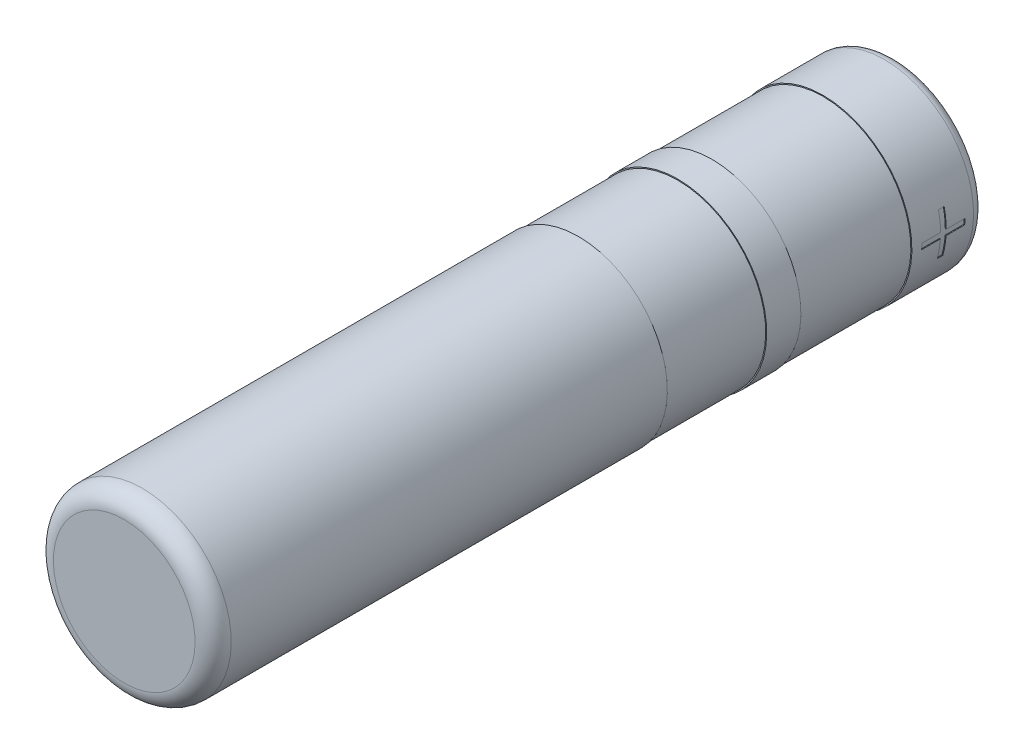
ISO-10303-21;
HEADER;
FILE_DESCRIPTION(('STEP AP214'),'2;1');
FILE_NAME('part.step','',(''),(''),'','','');
FILE_SCHEMA(('AUTOMOTIVE_DESIGN { 1 0 10303 214 1 1 1 1 }'));
ENDSEC;
DATA;
#1=APPLICATION_CONTEXT('core data for automotive mechanical design processes');
#2=APPLICATION_PROTOCOL_DEFINITION('international standard','automotive_design',2000,#1);
#3=PRODUCT_CONTEXT('',#1,'mechanical');
#4=PRODUCT('Part','Part','',(#3));
#5=PRODUCT_RELATED_PRODUCT_CATEGORY('part','',(#4));
#6=PRODUCT_DEFINITION_FORMATION('','',#4);
#7=PRODUCT_DEFINITION_CONTEXT('part definition',#1,'design');
#8=PRODUCT_DEFINITION('design','',#6,#7);
#9=PRODUCT_DEFINITION_SHAPE('','',#8);
#10=(LENGTH_UNIT() NAMED_UNIT(*) SI_UNIT(.MILLI.,.METRE.));
#11=(NAMED_UNIT(*) PLANE_ANGLE_UNIT() SI_UNIT($,.RADIAN.));
#12=(NAMED_UNIT(*) SI_UNIT($,.STERADIAN.) SOLID_ANGLE_UNIT());
#13=UNCERTAINTY_MEASURE_WITH_UNIT(LENGTH_MEASURE(1.E-05),#10,'distance_accuracy_value','');
#14=(GEOMETRIC_REPRESENTATION_CONTEXT(3) GLOBAL_UNCERTAINTY_ASSIGNED_CONTEXT((#13)) GLOBAL_UNIT_ASSIGNED_CONTEXT((#10,
#11,#12)) REPRESENTATION_CONTEXT('',''));
#15=CARTESIAN_POINT('',(0.,0.,0.));
#16=DIRECTION('',(0.,0.,1.));
#17=DIRECTION('',(1.,0.,0.));
#18=AXIS2_PLACEMENT_3D('',#15,#16,#17);
#19=CARTESIAN_POINT('',(0.,0.,-44.24));
#20=DIRECTION('',(0.,0.,-1.));
#21=DIRECTION('',(0.,1.,0.));
#22=AXIS2_PLACEMENT_3D('',#19,#20,#21);
#23=CYLINDRICAL_SURFACE('',#22,4.915);
#24=CARTESIAN_POINT('',(0.,0.,-42.04));
#25=DIRECTION('',(0.,0.,-1.));
#26=DIRECTION('',(0.,1.,0.));
#27=AXIS2_PLACEMENT_3D('',#24,#25,#26);
#28=CIRCLE('',#27,4.915);
#29=CARTESIAN_POINT('',(0.,4.91499999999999,-42.04));
#30=VERTEX_POINT('',#29);
#31=EDGE_CURVE('E185',#30,#30,#28,.T.);
#32=ORIENTED_EDGE('',*,*,#31,.F.);
#33=EDGE_LOOP('',(#32));
#34=FACE_BOUND('',#33,.T.);
#35=CARTESIAN_POINT('',(0.,0.,-38.6323807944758));
#36=DIRECTION('',(0.,0.,-1.));
#37=DIRECTION('',(0.,1.,0.));
#38=AXIS2_PLACEMENT_3D('',#35,#36,#37);
#39=CIRCLE('',#38,4.915);
#40=CARTESIAN_POINT('',(0.,4.91499999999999,-38.6323807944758));
#41=VERTEX_POINT('',#40);
#42=EDGE_CURVE('E188',#41,#41,#39,.T.);
#43=ORIENTED_EDGE('',*,*,#42,.T.);
#44=EDGE_LOOP('',(#43));
#45=FACE_BOUND('',#44,.T.);
#46=CARTESIAN_POINT('',(0.,0.,-40.2137290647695));
#47=DIRECTION('',(0.,0.,-1.));
#48=DIRECTION('',(-1.,0.,0.));
#49=AXIS2_PLACEMENT_3D('',#46,#47,#48);
#50=CIRCLE('',#49,4.915);
#51=CARTESIAN_POINT('',(4.72970311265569,-1.33683711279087,-40.2137290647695));
#52=VERTEX_POINT('',#51);
#53=CARTESIAN_POINT('',(4.90554080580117,-0.304785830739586,-40.2137290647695));
#54=VERTEX_POINT('',#53);
#55=EDGE_CURVE('E50',#52,#54,#50,.F.);
#56=ORIENTED_EDGE('',*,*,#55,.T.);
#57=DIRECTION('',(0.,0.,-1.));
#58=VECTOR('',#57,1.);
#59=CARTESIAN_POINT('',(4.90554080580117,-0.304785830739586,-44.24));
#60=LINE('',#59,#58);
#61=CARTESIAN_POINT('',(4.90554080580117,-0.304785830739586,-39.1816777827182));
#62=VERTEX_POINT('',#61);
#63=EDGE_CURVE('E12',#54,#62,#60,.F.);
#64=ORIENTED_EDGE('',*,*,#63,.T.);
#65=CARTESIAN_POINT('',(0.,0.,-39.1816777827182));
#66=DIRECTION('',(0.,0.,-1.));
#67=DIRECTION('',(-1.,0.,0.));
#68=AXIS2_PLACEMENT_3D('',#65,#66,#67);
#69=CIRCLE('',#68,4.915);
#70=CARTESIAN_POINT('',(4.91499116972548,0.00931673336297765,-39.1816777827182));
#71=VERTEX_POINT('',#70);
#72=EDGE_CURVE('E35',#62,#71,#69,.F.);
#73=ORIENTED_EDGE('',*,*,#72,.T.);
#74=DIRECTION('',(0.,0.,-1.));
#75=VECTOR('',#74,1.);
#76=CARTESIAN_POINT('',(4.91499116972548,0.00931673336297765,-44.24));
#77=LINE('',#76,#75);
#78=CARTESIAN_POINT('',(4.91499116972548,0.00931673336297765,-40.2137290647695));
#79=VERTEX_POINT('',#78);
#80=EDGE_CURVE('E240',#71,#79,#77,.T.);
#81=ORIENTED_EDGE('',*,*,#80,.T.);
#82=CARTESIAN_POINT('',(0.,0.,-40.2137290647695));
#83=DIRECTION('',(0.,0.,-1.));
#84=DIRECTION('',(-1.,0.,0.));
#85=AXIS2_PLACEMENT_3D('',#82,#83,#84);
#86=CIRCLE('',#85,4.915);
#87=CARTESIAN_POINT('',(4.80341312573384,1.04136801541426,-40.2137290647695));
#88=VERTEX_POINT('',#87);
#89=EDGE_CURVE('E238',#79,#88,#86,.F.);
#90=ORIENTED_EDGE('',*,*,#89,.T.);
#91=DIRECTION('',(0.,0.,-1.));
#92=VECTOR('',#91,1.);
#93=CARTESIAN_POINT('',(4.80341312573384,1.04136801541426,-44.24));
#94=LINE('',#93,#92);
#95=CARTESIAN_POINT('',(4.80341312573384,1.04136801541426,-40.5278316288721));
#96=VERTEX_POINT('',#95);
#97=EDGE_CURVE('E137',#88,#96,#94,.T.);
#98=ORIENTED_EDGE('',*,*,#97,.T.);
#99=CARTESIAN_POINT('',(0.,0.,-40.5278316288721));
#100=DIRECTION('',(0.,0.,1.));
#101=DIRECTION('',(1.,0.,0.));
#102=AXIS2_PLACEMENT_3D('',#99,#100,#101);
#103=CIRCLE('',#102,4.915);
#104=CARTESIAN_POINT('',(4.91499116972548,0.00931673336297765,-40.5278316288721));
#105=VERTEX_POINT('',#104);
#106=EDGE_CURVE('E234',#96,#105,#103,.F.);
#107=ORIENTED_EDGE('',*,*,#106,.T.);
#108=DIRECTION('',(0.,0.,-1.));
#109=VECTOR('',#108,1.);
#110=CARTESIAN_POINT('',(4.91499116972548,0.00931673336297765,-44.24));
#111=LINE('',#110,#109);
#112=CARTESIAN_POINT('',(4.91499116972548,0.00931673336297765,-41.5598829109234));
#113=VERTEX_POINT('',#112);
#114=EDGE_CURVE('E230',#105,#113,#111,.T.);
#115=ORIENTED_EDGE('',*,*,#114,.T.);
#116=CARTESIAN_POINT('',(0.,0.,-41.5598829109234));
#117=DIRECTION('',(0.,0.,1.));
#118=DIRECTION('',(1.,0.,0.));
#119=AXIS2_PLACEMENT_3D('',#116,#117,#118);
#120=CIRCLE('',#119,4.915);
#121=CARTESIAN_POINT('',(4.90554080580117,-0.304785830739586,-41.5598829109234));
#122=VERTEX_POINT('',#121);
#123=EDGE_CURVE('E227',#113,#122,#120,.F.);
#124=ORIENTED_EDGE('',*,*,#123,.T.);
#125=DIRECTION('',(0.,0.,-1.));
#126=VECTOR('',#125,1.);
#127=CARTESIAN_POINT('',(4.90554080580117,-0.304785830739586,-44.24));
#128=LINE('',#127,#126);
#129=CARTESIAN_POINT('',(4.90554080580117,-0.304785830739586,-40.5278316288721));
#130=VERTEX_POINT('',#129);
#131=EDGE_CURVE('E224',#122,#130,#128,.F.);
#132=ORIENTED_EDGE('',*,*,#131,.T.);
#133=CARTESIAN_POINT('',(0.,0.,-40.5278316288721));
#134=DIRECTION('',(0.,0.,1.));
#135=DIRECTION('',(1.,0.,0.));
#136=AXIS2_PLACEMENT_3D('',#133,#134,#135);
#137=CIRCLE('',#136,4.915);
#138=CARTESIAN_POINT('',(4.72970311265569,-1.33683711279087,-40.5278316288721));
#139=VERTEX_POINT('',#138);
#140=EDGE_CURVE('E218',#130,#139,#137,.F.);
#141=ORIENTED_EDGE('',*,*,#140,.T.);
#142=DIRECTION('',(0.,0.,-1.));
#143=VECTOR('',#142,1.);
#144=CARTESIAN_POINT('',(4.72970311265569,-1.33683711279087,-44.24));
#145=LINE('',#144,#143);
#146=EDGE_CURVE('E221',#139,#52,#145,.F.);
#147=ORIENTED_EDGE('',*,*,#146,.T.);
#148=EDGE_LOOP('',(#56,#64,#73,#81,#90,#98,#107,#115,#124,#132,#141,#147));
#149=FACE_BOUND('',#148,.T.);
#150=ADVANCED_FACE('F27',(#34,#45,#149),#23,.T.);
#151=CARTESIAN_POINT('',(0.,0.,0.));
#152=DIRECTION('',(0.,0.,1.));
#153=DIRECTION('',(0.,-1.,0.));
#154=AXIS2_PLACEMENT_3D('',#151,#152,#153);
#155=PLANE('',#154);
#156=CARTESIAN_POINT('',(0.,0.,0.));
#157=DIRECTION('',(0.,0.,-1.));
#158=DIRECTION('',(0.,1.,0.));
#159=AXIS2_PLACEMENT_3D('',#156,#157,#158);
#160=CIRCLE('',#159,3.91499999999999);
#161=CARTESIAN_POINT('',(0.,3.91499999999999,0.));
#162=VERTEX_POINT('',#161);
#163=EDGE_CURVE('E215',#162,#162,#160,.T.);
#164=ORIENTED_EDGE('',*,*,#163,.F.);
#165=EDGE_LOOP('',(#164));
#166=FACE_BOUND('',#165,.T.);
#167=ADVANCED_FACE('F29',(#166),#155,.T.);
#168=CARTESIAN_POINT('',(0.,0.,-1.));
#169=DIRECTION('',(0.,0.,-1.));
#170=DIRECTION('',(0.,1.,0.));
#171=AXIS2_PLACEMENT_3D('',#168,#169,#170);
#172=TOROIDAL_SURFACE('',#171,3.91499999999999,1.);
#173=ORIENTED_EDGE('',*,*,#163,.T.);
#174=EDGE_LOOP('',(#173));
#175=FACE_BOUND('',#174,.T.);
#176=CARTESIAN_POINT('',(0.,0.,-1.00000000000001));
#177=DIRECTION('',(0.,0.,-1.));
#178=DIRECTION('',(0.,1.,0.));
#179=AXIS2_PLACEMENT_3D('',#176,#177,#178);
#180=CIRCLE('',#179,4.91499999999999);
#181=CARTESIAN_POINT('',(0.,4.91499999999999,-1.00000000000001));
#182=VERTEX_POINT('',#181);
#183=EDGE_CURVE('E212',#182,#182,#180,.T.);
#184=ORIENTED_EDGE('',*,*,#183,.F.);
#185=EDGE_LOOP('',(#184));
#186=FACE_BOUND('',#185,.T.);
#187=ADVANCED_FACE('F300',(#175,#186),#172,.T.);
#188=CARTESIAN_POINT('',(0.,0.,-44.24));
#189=DIRECTION('',(0.,0.,-1.));
#190=DIRECTION('',(0.,1.,0.));
#191=AXIS2_PLACEMENT_3D('',#188,#189,#190);
#192=CYLINDRICAL_SURFACE('',#191,4.91499999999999);
#193=ORIENTED_EDGE('',*,*,#183,.T.);
#194=EDGE_LOOP('',(#193));
#195=FACE_BOUND('',#194,.T.);
#196=CARTESIAN_POINT('',(0.,0.,-25.110594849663));
#197=DIRECTION('',(0.,0.,-1.));
#198=DIRECTION('',(0.,1.,0.));
#199=AXIS2_PLACEMENT_3D('',#196,#197,#198);
#200=CIRCLE('',#199,4.915);
#201=CARTESIAN_POINT('',(0.,4.91499999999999,-25.110594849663));
#202=VERTEX_POINT('',#201);
#203=EDGE_CURVE('E209',#202,#202,#200,.T.);
#204=ORIENTED_EDGE('',*,*,#203,.F.);
#205=EDGE_LOOP('',(#204));
#206=FACE_BOUND('',#205,.T.);
#207=ADVANCED_FACE('F335',(#195,#206),#192,.T.);
#208=CARTESIAN_POINT('',(0.,4.91499999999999,-25.110594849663));
#209=DIRECTION('',(0.,0.,-1.));
#210=DIRECTION('',(0.,1.,0.));
#211=AXIS2_PLACEMENT_3D('',#208,#209,#210);
#212=PLANE('',#211);
#213=ORIENTED_EDGE('',*,*,#203,.T.);
#214=EDGE_LOOP('',(#213));
#215=FACE_BOUND('',#214,.T.);
#216=CARTESIAN_POINT('',(0.,0.,-25.110594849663));
#217=DIRECTION('',(0.,0.,-1.));
#218=DIRECTION('',(0.,1.,0.));
#219=AXIS2_PLACEMENT_3D('',#216,#217,#218);
#220=CIRCLE('',#219,4.85901048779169);
#221=CARTESIAN_POINT('',(0.,4.85901048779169,-25.110594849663));
#222=VERTEX_POINT('',#221);
#223=EDGE_CURVE('E206',#222,#222,#220,.T.);
#224=ORIENTED_EDGE('',*,*,#223,.F.);
#225=EDGE_LOOP('',(#224));
#226=FACE_BOUND('',#225,.T.);
#227=ADVANCED_FACE('F331',(#215,#226),#212,.T.);
#228=CARTESIAN_POINT('',(0.,0.,-44.24));
#229=DIRECTION('',(0.,0.,-1.));
#230=DIRECTION('',(0.,1.,0.));
#231=AXIS2_PLACEMENT_3D('',#228,#229,#230);
#232=CYLINDRICAL_SURFACE('',#231,4.85901048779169);
#233=ORIENTED_EDGE('',*,*,#223,.T.);
#234=EDGE_LOOP('',(#233));
#235=FACE_BOUND('',#234,.T.);
#236=CARTESIAN_POINT('',(0.,0.,-30.6049353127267));
#237=DIRECTION('',(0.,0.,-1.));
#238=DIRECTION('',(0.,1.,0.));
#239=AXIS2_PLACEMENT_3D('',#236,#237,#238);
#240=CIRCLE('',#239,4.8590104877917);
#241=CARTESIAN_POINT('',(0.,4.85901048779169,-30.6049353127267));
#242=VERTEX_POINT('',#241);
#243=EDGE_CURVE('E203',#242,#242,#240,.T.);
#244=ORIENTED_EDGE('',*,*,#243,.F.);
#245=EDGE_LOOP('',(#244));
#246=FACE_BOUND('',#245,.T.);
#247=ADVANCED_FACE('F327',(#235,#246),#232,.T.);
#248=CARTESIAN_POINT('',(0.,4.91499999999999,-30.6049353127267));
#249=DIRECTION('',(0.,0.,1.));
#250=DIRECTION('',(0.,-1.,0.));
#251=AXIS2_PLACEMENT_3D('',#248,#249,#250);
#252=PLANE('',#251);
#253=ORIENTED_EDGE('',*,*,#243,.T.);
#254=EDGE_LOOP('',(#253));
#255=FACE_BOUND('',#254,.T.);
#256=CARTESIAN_POINT('',(0.,0.,-30.6049353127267));
#257=DIRECTION('',(0.,0.,-1.));
#258=DIRECTION('',(0.,1.,0.));
#259=AXIS2_PLACEMENT_3D('',#256,#257,#258);
#260=CIRCLE('',#259,4.915);
#261=CARTESIAN_POINT('',(0.,4.91499999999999,-30.6049353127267));
#262=VERTEX_POINT('',#261);
#263=EDGE_CURVE('E200',#262,#262,#260,.T.);
#264=ORIENTED_EDGE('',*,*,#263,.F.);
#265=EDGE_LOOP('',(#264));
#266=FACE_BOUND('',#265,.T.);
#267=ADVANCED_FACE('F323',(#255,#266),#252,.T.);
#268=CARTESIAN_POINT('',(0.,0.,-44.24));
#269=DIRECTION('',(0.,0.,-1.));
#270=DIRECTION('',(0.,1.,0.));
#271=AXIS2_PLACEMENT_3D('',#268,#269,#270);
#272=CYLINDRICAL_SURFACE('',#271,4.915);
#273=ORIENTED_EDGE('',*,*,#263,.T.);
#274=EDGE_LOOP('',(#273));
#275=FACE_BOUND('',#274,.T.);
#276=CARTESIAN_POINT('',(0.,0.,-32.4958446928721));
#277=DIRECTION('',(0.,0.,-1.));
#278=DIRECTION('',(0.,1.,0.));
#279=AXIS2_PLACEMENT_3D('',#276,#277,#278);
#280=CIRCLE('',#279,4.915);
#281=CARTESIAN_POINT('',(0.,4.91499999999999,-32.4958446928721));
#282=VERTEX_POINT('',#281);
#283=EDGE_CURVE('E197',#282,#282,#280,.T.);
#284=ORIENTED_EDGE('',*,*,#283,.F.);
#285=EDGE_LOOP('',(#284));
#286=FACE_BOUND('',#285,.T.);
#287=ADVANCED_FACE('F319',(#275,#286),#272,.T.);
#288=CARTESIAN_POINT('',(0.,4.91499999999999,-32.4958446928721));
#289=DIRECTION('',(0.,0.,-1.));
#290=DIRECTION('',(0.,1.,0.));
#291=AXIS2_PLACEMENT_3D('',#288,#289,#290);
#292=PLANE('',#291);
#293=ORIENTED_EDGE('',*,*,#283,.T.);
#294=EDGE_LOOP('',(#293));
#295=FACE_BOUND('',#294,.T.);
#296=CARTESIAN_POINT('',(0.,0.,-32.4958446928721));
#297=DIRECTION('',(0.,0.,-1.));
#298=DIRECTION('',(0.,1.,0.));
#299=AXIS2_PLACEMENT_3D('',#296,#297,#298);
#300=CIRCLE('',#299,4.8590104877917);
#301=CARTESIAN_POINT('',(0.,4.85901048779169,-32.4958446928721));
#302=VERTEX_POINT('',#301);
#303=EDGE_CURVE('E194',#302,#302,#300,.T.);
#304=ORIENTED_EDGE('',*,*,#303,.F.);
#305=EDGE_LOOP('',(#304));
#306=FACE_BOUND('',#305,.T.);
#307=ADVANCED_FACE('F315',(#295,#306),#292,.T.);
#308=CARTESIAN_POINT('',(0.,0.,-44.24));
#309=DIRECTION('',(0.,0.,-1.));
#310=DIRECTION('',(0.,1.,0.));
#311=AXIS2_PLACEMENT_3D('',#308,#309,#310);
#312=CYLINDRICAL_SURFACE('',#311,4.8590104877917);
#313=ORIENTED_EDGE('',*,*,#303,.T.);
#314=EDGE_LOOP('',(#313));
#315=FACE_BOUND('',#314,.T.);
#316=CARTESIAN_POINT('',(0.,0.,-38.6323807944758));
#317=DIRECTION('',(0.,0.,-1.));
#318=DIRECTION('',(0.,1.,0.));
#319=AXIS2_PLACEMENT_3D('',#316,#317,#318);
#320=CIRCLE('',#319,4.8590104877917);
#321=CARTESIAN_POINT('',(0.,4.85901048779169,-38.6323807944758));
#322=VERTEX_POINT('',#321);
#323=EDGE_CURVE('E191',#322,#322,#320,.T.);
#324=ORIENTED_EDGE('',*,*,#323,.F.);
#325=EDGE_LOOP('',(#324));
#326=FACE_BOUND('',#325,.T.);
#327=ADVANCED_FACE('F311',(#315,#326),#312,.T.);
#328=CARTESIAN_POINT('',(0.,4.91499999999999,-38.6323807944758));
#329=DIRECTION('',(0.,0.,1.));
#330=DIRECTION('',(0.,-1.,0.));
#331=AXIS2_PLACEMENT_3D('',#328,#329,#330);
#332=PLANE('',#331);
#333=ORIENTED_EDGE('',*,*,#323,.T.);
#334=EDGE_LOOP('',(#333));
#335=FACE_BOUND('',#334,.T.);
#336=ORIENTED_EDGE('',*,*,#42,.F.);
#337=EDGE_LOOP('',(#336));
#338=FACE_BOUND('',#337,.T.);
#339=ADVANCED_FACE('F308',(#335,#338),#332,.T.);
#340=CARTESIAN_POINT('',(0.,0.,-42.04));
#341=DIRECTION('',(0.,0.,-1.));
#342=DIRECTION('',(0.,1.,0.));
#343=AXIS2_PLACEMENT_3D('',#340,#341,#342);
#344=TOROIDAL_SURFACE('',#343,4.315,0.600000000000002);
#345=ORIENTED_EDGE('',*,*,#31,.T.);
#346=EDGE_LOOP('',(#345));
#347=FACE_BOUND('',#346,.T.);
#348=CARTESIAN_POINT('',(0.,0.,-42.64));
#349=DIRECTION('',(0.,0.,-1.));
#350=DIRECTION('',(0.,1.,0.));
#351=AXIS2_PLACEMENT_3D('',#348,#349,#350);
#352=CIRCLE('',#351,4.31499999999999);
#353=CARTESIAN_POINT('',(0.,4.31499999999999,-42.64));
#354=VERTEX_POINT('',#353);
#355=EDGE_CURVE('E182',#354,#354,#352,.T.);
#356=ORIENTED_EDGE('',*,*,#355,.F.);
#357=EDGE_LOOP('',(#356));
#358=FACE_BOUND('',#357,.T.);
#359=ADVANCED_FACE('F306',(#347,#358),#344,.T.);
#360=CARTESIAN_POINT('',(0.,4.31499999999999,-42.64));
#361=DIRECTION('',(0.,0.,-1.));
#362=DIRECTION('',(0.,1.,0.));
#363=AXIS2_PLACEMENT_3D('',#360,#361,#362);
#364=PLANE('',#363);
#365=ORIENTED_EDGE('',*,*,#355,.T.);
#366=EDGE_LOOP('',(#365));
#367=FACE_BOUND('',#366,.T.);
#368=CARTESIAN_POINT('',(0.,0.,-42.64));
#369=DIRECTION('',(0.,0.,-1.));
#370=DIRECTION('',(0.,1.,0.));
#371=AXIS2_PLACEMENT_3D('',#368,#369,#370);
#372=CIRCLE('',#371,1.18024566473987);
#373=CARTESIAN_POINT('',(0.,1.18024566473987,-42.64));
#374=VERTEX_POINT('',#373);
#375=EDGE_CURVE('E179',#374,#374,#372,.T.);
#376=ORIENTED_EDGE('',*,*,#375,.F.);
#377=EDGE_LOOP('',(#376));
#378=FACE_BOUND('',#377,.T.);
#379=ADVANCED_FACE('F402',(#367,#378),#364,.T.);
#380=CARTESIAN_POINT('',(0.,0.,-44.24));
#381=DIRECTION('',(0.,0.,-1.));
#382=DIRECTION('',(0.,1.,0.));
#383=AXIS2_PLACEMENT_3D('',#380,#381,#382);
#384=CYLINDRICAL_SURFACE('',#383,1.18024566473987);
#385=ORIENTED_EDGE('',*,*,#375,.T.);
#386=EDGE_LOOP('',(#385));
#387=FACE_BOUND('',#386,.T.);
#388=CARTESIAN_POINT('',(0.,0.,-43.64));
#389=DIRECTION('',(0.,0.,-1.));
#390=DIRECTION('',(0.,1.,0.));
#391=AXIS2_PLACEMENT_3D('',#388,#389,#390);
#392=CIRCLE('',#391,1.18024566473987);
#393=CARTESIAN_POINT('',(0.,1.18024566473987,-43.64));
#394=VERTEX_POINT('',#393);
#395=EDGE_CURVE('E175',#394,#394,#392,.T.);
#396=ORIENTED_EDGE('',*,*,#395,.F.);
#397=EDGE_LOOP('',(#396));
#398=FACE_BOUND('',#397,.T.);
#399=ADVANCED_FACE('F409',(#387,#398),#384,.T.);
#400=CARTESIAN_POINT('',(0.,0.,-43.64));
#401=DIRECTION('',(0.,0.,-1.));
#402=DIRECTION('',(0.,1.,0.));
#403=AXIS2_PLACEMENT_3D('',#400,#401,#402);
#404=DEGENERATE_TOROIDAL_SURFACE('',#403,0.580245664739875,0.600000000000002,.T.);
#405=ORIENTED_EDGE('',*,*,#395,.T.);
#406=EDGE_LOOP('',(#405));
#407=FACE_BOUND('',#406,.T.);
#408=CARTESIAN_POINT('',(0.,0.,-44.24));
#409=DIRECTION('',(0.,0.,-1.));
#410=DIRECTION('',(0.,1.,0.));
#411=AXIS2_PLACEMENT_3D('',#408,#409,#410);
#412=CIRCLE('',#411,0.580245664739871);
#413=CARTESIAN_POINT('',(0.,0.580245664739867,-44.24));
#414=VERTEX_POINT('',#413);
#415=EDGE_CURVE('E172',#414,#414,#412,.T.);
#416=ORIENTED_EDGE('',*,*,#415,.F.);
#417=EDGE_LOOP('',(#416));
#418=FACE_BOUND('',#417,.T.);
#419=ADVANCED_FACE('F416',(#407,#418),#404,.T.);
#420=CARTESIAN_POINT('',(0.,0.580245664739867,-44.24));
#421=DIRECTION('',(0.,0.,-1.));
#422=DIRECTION('',(0.,1.,0.));
#423=AXIS2_PLACEMENT_3D('',#420,#421,#422);
#424=PLANE('',#423);
#425=ORIENTED_EDGE('',*,*,#415,.T.);
#426=EDGE_LOOP('',(#425));
#427=FACE_BOUND('',#426,.T.);
#428=ADVANCED_FACE('F423',(#427),#424,.T.);
#429=CARTESIAN_POINT('',(-5.016,1.04136801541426,-40.5278316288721));
#430=DIRECTION('',(0.,0.,1.));
#431=DIRECTION('',(1.,0.,0.));
#432=AXIS2_PLACEMENT_3D('',#429,#430,#431);
#433=PLANE('',#432);
#434=DIRECTION('',(1.,0.,0.));
#435=VECTOR('',#434,1.);
#436=CARTESIAN_POINT('',(-5.016,1.04136801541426,-40.5278316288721));
#437=LINE('',#436,#435);
#438=CARTESIAN_POINT('',(4.75341312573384,1.04136801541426,-40.5278316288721));
#439=VERTEX_POINT('',#438);
#440=EDGE_CURVE('E170',#439,#96,#437,.T.);
#441=ORIENTED_EDGE('',*,*,#440,.F.);
#442=CARTESIAN_POINT('',(-0.05,0.,-40.5278316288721));
#443=DIRECTION('',(0.,0.,1.));
#444=DIRECTION('',(1.,0.,0.));
#445=AXIS2_PLACEMENT_3D('',#442,#443,#444);
#446=CIRCLE('',#445,4.915);
#447=CARTESIAN_POINT('',(4.86499116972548,0.00931673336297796,-40.5278316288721));
#448=VERTEX_POINT('',#447);
#449=EDGE_CURVE('E143',#448,#439,#446,.T.);
#450=ORIENTED_EDGE('',*,*,#449,.F.);
#451=DIRECTION('',(1.,0.,0.));
#452=VECTOR('',#451,1.);
#453=CARTESIAN_POINT('',(-5.016,0.00931673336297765,-40.5278316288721));
#454=LINE('',#453,#452);
#455=EDGE_CURVE('E263',#448,#105,#454,.T.);
#456=ORIENTED_EDGE('',*,*,#455,.T.);
#457=ORIENTED_EDGE('',*,*,#106,.F.);
#458=EDGE_LOOP('',(#441,#450,#456,#457));
#459=FACE_BOUND('',#458,.T.);
#460=ADVANCED_FACE('F430',(#459),#433,.T.);
#461=CARTESIAN_POINT('',(-5.016,-0.304785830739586,-41.5598829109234));
#462=DIRECTION('',(0.,1.,0.));
#463=DIRECTION('',(0.,0.,1.));
#464=AXIS2_PLACEMENT_3D('',#461,#462,#463);
#465=PLANE('',#464);
#466=DIRECTION('',(1.,0.,0.));
#467=VECTOR('',#466,1.);
#468=CARTESIAN_POINT('',(-5.016,-0.304785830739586,-41.5598829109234));
#469=LINE('',#468,#467);
#470=CARTESIAN_POINT('',(4.85554080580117,-0.304785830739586,-41.5598829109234));
#471=VERTEX_POINT('',#470);
#472=EDGE_CURVE('E166',#471,#122,#469,.T.);
#473=ORIENTED_EDGE('',*,*,#472,.F.);
#474=DIRECTION('',(0.,0.,-1.));
#475=VECTOR('',#474,1.);
#476=CARTESIAN_POINT('',(4.85554080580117,-0.304785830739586,-44.24));
#477=LINE('',#476,#475);
#478=CARTESIAN_POINT('',(4.85554080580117,-0.304785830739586,-40.5278316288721));
#479=VERTEX_POINT('',#478);
#480=EDGE_CURVE('E167',#479,#471,#477,.T.);
#481=ORIENTED_EDGE('',*,*,#480,.F.);
#482=DIRECTION('',(1.,0.,0.));
#483=VECTOR('',#482,1.);
#484=CARTESIAN_POINT('',(-5.016,-0.304785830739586,-40.5278316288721));
#485=LINE('',#484,#483);
#486=EDGE_CURVE('E176',#479,#130,#485,.T.);
#487=ORIENTED_EDGE('',*,*,#486,.T.);
#488=ORIENTED_EDGE('',*,*,#131,.F.);
#489=EDGE_LOOP('',(#473,#481,#487,#488));
#490=FACE_BOUND('',#489,.T.);
#491=ADVANCED_FACE('F282',(#490),#465,.T.);
#492=CARTESIAN_POINT('',(-5.016,-1.33683711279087,-40.5278316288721));
#493=DIRECTION('',(0.,1.,0.));
#494=DIRECTION('',(0.,0.,1.));
#495=AXIS2_PLACEMENT_3D('',#492,#493,#494);
#496=PLANE('',#495);
#497=DIRECTION('',(1.,0.,0.));
#498=VECTOR('',#497,1.);
#499=CARTESIAN_POINT('',(-5.016,-1.33683711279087,-40.5278316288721));
#500=LINE('',#499,#498);
#501=CARTESIAN_POINT('',(4.6797031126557,-1.33683711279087,-40.5278316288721));
#502=VERTEX_POINT('',#501);
#503=EDGE_CURVE('E42',#502,#139,#500,.T.);
#504=ORIENTED_EDGE('',*,*,#503,.F.);
#505=DIRECTION('',(0.,0.,-1.));
#506=VECTOR('',#505,1.);
#507=CARTESIAN_POINT('',(4.6797031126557,-1.33683711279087,-44.24));
#508=LINE('',#507,#506);
#509=CARTESIAN_POINT('',(4.6797031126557,-1.33683711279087,-40.2137290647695));
#510=VERTEX_POINT('',#509);
#511=EDGE_CURVE('E163',#510,#502,#508,.T.);
#512=ORIENTED_EDGE('',*,*,#511,.F.);
#513=DIRECTION('',(1.,0.,0.));
#514=VECTOR('',#513,1.);
#515=CARTESIAN_POINT('',(-5.016,-1.33683711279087,-40.2137290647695));
#516=LINE('',#515,#514);
#517=EDGE_CURVE('E159',#510,#52,#516,.T.);
#518=ORIENTED_EDGE('',*,*,#517,.T.);
#519=ORIENTED_EDGE('',*,*,#146,.F.);
#520=EDGE_LOOP('',(#504,#512,#518,#519));
#521=FACE_BOUND('',#520,.T.);
#522=ADVANCED_FACE('F277',(#521),#496,.T.);
#523=CARTESIAN_POINT('',(-5.016,-1.33683711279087,-40.2137290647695));
#524=DIRECTION('',(0.,0.,-1.));
#525=DIRECTION('',(-1.,0.,0.));
#526=AXIS2_PLACEMENT_3D('',#523,#524,#525);
#527=PLANE('',#526);
#528=ORIENTED_EDGE('',*,*,#517,.F.);
#529=CARTESIAN_POINT('',(-0.05,0.,-40.2137290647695));
#530=DIRECTION('',(0.,0.,-1.));
#531=DIRECTION('',(-1.,0.,0.));
#532=AXIS2_PLACEMENT_3D('',#529,#530,#531);
#533=CIRCLE('',#532,4.915);
#534=CARTESIAN_POINT('',(4.85554080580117,-0.304785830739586,-40.2137290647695));
#535=VERTEX_POINT('',#534);
#536=EDGE_CURVE('E160',#535,#510,#533,.T.);
#537=ORIENTED_EDGE('',*,*,#536,.F.);
#538=DIRECTION('',(1.,0.,0.));
#539=VECTOR('',#538,1.);
#540=CARTESIAN_POINT('',(-5.016,-0.304785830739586,-40.2137290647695));
#541=LINE('',#540,#539);
#542=EDGE_CURVE('E155',#535,#54,#541,.T.);
#543=ORIENTED_EDGE('',*,*,#542,.T.);
#544=ORIENTED_EDGE('',*,*,#55,.F.);
#545=EDGE_LOOP('',(#528,#537,#543,#544));
#546=FACE_BOUND('',#545,.T.);
#547=ADVANCED_FACE('F283',(#546),#527,.T.);
#548=CARTESIAN_POINT('',(-5.016,-0.304785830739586,-40.2137290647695));
#549=DIRECTION('',(0.,1.,0.));
#550=DIRECTION('',(0.,0.,1.));
#551=AXIS2_PLACEMENT_3D('',#548,#549,#550);
#552=PLANE('',#551);
#553=ORIENTED_EDGE('',*,*,#542,.F.);
#554=DIRECTION('',(0.,0.,-1.));
#555=VECTOR('',#554,1.);
#556=CARTESIAN_POINT('',(4.85554080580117,-0.304785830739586,-44.24));
#557=LINE('',#556,#555);
#558=CARTESIAN_POINT('',(4.85554080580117,-0.304785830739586,-39.1816777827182));
#559=VERTEX_POINT('',#558);
#560=EDGE_CURVE('E156',#559,#535,#557,.T.);
#561=ORIENTED_EDGE('',*,*,#560,.F.);
#562=DIRECTION('',(1.,0.,0.));
#563=VECTOR('',#562,1.);
#564=CARTESIAN_POINT('',(-5.016,-0.304785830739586,-39.1816777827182));
#565=LINE('',#564,#563);
#566=EDGE_CURVE('E151',#559,#62,#565,.T.);
#567=ORIENTED_EDGE('',*,*,#566,.T.);
#568=ORIENTED_EDGE('',*,*,#63,.F.);
#569=EDGE_LOOP('',(#553,#561,#567,#568));
#570=FACE_BOUND('',#569,.T.);
#571=ADVANCED_FACE('F252',(#570),#552,.T.);
#572=CARTESIAN_POINT('',(-5.016,-0.304785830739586,-39.1816777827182));
#573=DIRECTION('',(0.,0.,-1.));
#574=DIRECTION('',(-1.,0.,0.));
#575=AXIS2_PLACEMENT_3D('',#572,#573,#574);
#576=PLANE('',#575);
#577=ORIENTED_EDGE('',*,*,#566,.F.);
#578=CARTESIAN_POINT('',(-0.05,0.,-39.1816777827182));
#579=DIRECTION('',(0.,0.,-1.));
#580=DIRECTION('',(-1.,0.,0.));
#581=AXIS2_PLACEMENT_3D('',#578,#579,#580);
#582=CIRCLE('',#581,4.915);
#583=CARTESIAN_POINT('',(4.86499116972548,0.00931673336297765,-39.1816777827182));
#584=VERTEX_POINT('',#583);
#585=EDGE_CURVE('E152',#584,#559,#582,.T.);
#586=ORIENTED_EDGE('',*,*,#585,.F.);
#587=DIRECTION('',(1.,0.,0.));
#588=VECTOR('',#587,1.);
#589=CARTESIAN_POINT('',(-5.016,0.00931673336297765,-39.1816777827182));
#590=LINE('',#589,#588);
#591=EDGE_CURVE('E129',#584,#71,#590,.T.);
#592=ORIENTED_EDGE('',*,*,#591,.T.);
#593=ORIENTED_EDGE('',*,*,#72,.F.);
#594=EDGE_LOOP('',(#577,#586,#592,#593));
#595=FACE_BOUND('',#594,.T.);
#596=ADVANCED_FACE('F248',(#595),#576,.T.);
#597=CARTESIAN_POINT('',(-5.016,0.00931673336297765,-39.1816777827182));
#598=DIRECTION('',(0.,-1.,0.));
#599=DIRECTION('',(0.,0.,-1.));
#600=AXIS2_PLACEMENT_3D('',#597,#598,#599);
#601=PLANE('',#600);
#602=ORIENTED_EDGE('',*,*,#591,.F.);
#603=DIRECTION('',(0.,0.,-1.));
#604=VECTOR('',#603,1.);
#605=CARTESIAN_POINT('',(4.86499116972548,0.00931673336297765,-44.24));
#606=LINE('',#605,#604);
#607=CARTESIAN_POINT('',(4.86499116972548,0.00931673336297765,-40.2137290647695));
#608=VERTEX_POINT('',#607);
#609=EDGE_CURVE('E149',#608,#584,#606,.F.);
#610=ORIENTED_EDGE('',*,*,#609,.F.);
#611=DIRECTION('',(1.,0.,0.));
#612=VECTOR('',#611,1.);
#613=CARTESIAN_POINT('',(-5.016,0.00931673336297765,-40.2137290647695));
#614=LINE('',#613,#612);
#615=EDGE_CURVE('E125',#608,#79,#614,.T.);
#616=ORIENTED_EDGE('',*,*,#615,.T.);
#617=ORIENTED_EDGE('',*,*,#80,.F.);
#618=EDGE_LOOP('',(#602,#610,#616,#617));
#619=FACE_BOUND('',#618,.T.);
#620=ADVANCED_FACE('F463',(#619),#601,.T.);
#621=CARTESIAN_POINT('',(-5.016,0.00931673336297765,-40.2137290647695));
#622=DIRECTION('',(0.,0.,-1.));
#623=DIRECTION('',(-1.,0.,0.));
#624=AXIS2_PLACEMENT_3D('',#621,#622,#623);
#625=PLANE('',#624);
#626=ORIENTED_EDGE('',*,*,#615,.F.);
#627=CARTESIAN_POINT('',(-0.05,0.,-40.2137290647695));
#628=DIRECTION('',(0.,0.,-1.));
#629=DIRECTION('',(-1.,0.,0.));
#630=AXIS2_PLACEMENT_3D('',#627,#628,#629);
#631=CIRCLE('',#630,4.915);
#632=CARTESIAN_POINT('',(4.75341312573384,1.04136801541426,-40.2137290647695));
#633=VERTEX_POINT('',#632);
#634=EDGE_CURVE('E119',#633,#608,#631,.T.);
#635=ORIENTED_EDGE('',*,*,#634,.F.);
#636=DIRECTION('',(1.,0.,0.));
#637=VECTOR('',#636,1.);
#638=CARTESIAN_POINT('',(-5.016,1.04136801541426,-40.2137290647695));
#639=LINE('',#638,#637);
#640=EDGE_CURVE('E122',#633,#88,#639,.T.);
#641=ORIENTED_EDGE('',*,*,#640,.T.);
#642=ORIENTED_EDGE('',*,*,#89,.F.);
#643=EDGE_LOOP('',(#626,#635,#641,#642));
#644=FACE_BOUND('',#643,.T.);
#645=ADVANCED_FACE('F121',(#644),#625,.T.);
#646=CARTESIAN_POINT('',(-5.016,1.04136801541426,-40.2137290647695));
#647=DIRECTION('',(0.,-1.,0.));
#648=DIRECTION('',(0.,0.,-1.));
#649=AXIS2_PLACEMENT_3D('',#646,#647,#648);
#650=PLANE('',#649);
#651=ORIENTED_EDGE('',*,*,#640,.F.);
#652=DIRECTION('',(0.,0.,-1.));
#653=VECTOR('',#652,1.);
#654=CARTESIAN_POINT('',(4.75341312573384,1.04136801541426,-44.24));
#655=LINE('',#654,#653);
#656=EDGE_CURVE('E134',#439,#633,#655,.F.);
#657=ORIENTED_EDGE('',*,*,#656,.F.);
#658=ORIENTED_EDGE('',*,*,#440,.T.);
#659=ORIENTED_EDGE('',*,*,#97,.F.);
#660=EDGE_LOOP('',(#651,#657,#658,#659));
#661=FACE_BOUND('',#660,.T.);
#662=ADVANCED_FACE('F132',(#661),#650,.T.);
#663=CARTESIAN_POINT('',(-5.016,0.00931673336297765,-40.5278316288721));
#664=DIRECTION('',(0.,-1.,0.));
#665=DIRECTION('',(0.,0.,-1.));
#666=AXIS2_PLACEMENT_3D('',#663,#664,#665);
#667=PLANE('',#666);
#668=ORIENTED_EDGE('',*,*,#455,.F.);
#669=DIRECTION('',(0.,0.,-1.));
#670=VECTOR('',#669,1.);
#671=CARTESIAN_POINT('',(4.86499116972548,0.00931673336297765,-44.24));
#672=LINE('',#671,#670);
#673=CARTESIAN_POINT('',(4.86499116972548,0.00931673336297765,-41.5598829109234));
#674=VERTEX_POINT('',#673);
#675=EDGE_CURVE('E138',#674,#448,#672,.F.);
#676=ORIENTED_EDGE('',*,*,#675,.F.);
#677=DIRECTION('',(1.,0.,0.));
#678=VECTOR('',#677,1.);
#679=CARTESIAN_POINT('',(-5.016,0.00931673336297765,-41.5598829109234));
#680=LINE('',#679,#678);
#681=EDGE_CURVE('E260',#674,#113,#680,.T.);
#682=ORIENTED_EDGE('',*,*,#681,.T.);
#683=ORIENTED_EDGE('',*,*,#114,.F.);
#684=EDGE_LOOP('',(#668,#676,#682,#683));
#685=FACE_BOUND('',#684,.T.);
#686=ADVANCED_FACE('F483',(#685),#667,.T.);
#687=CARTESIAN_POINT('',(-5.016,0.00931673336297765,-41.5598829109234));
#688=DIRECTION('',(0.,0.,1.));
#689=DIRECTION('',(1.,0.,0.));
#690=AXIS2_PLACEMENT_3D('',#687,#688,#689);
#691=PLANE('',#690);
#692=ORIENTED_EDGE('',*,*,#681,.F.);
#693=CARTESIAN_POINT('',(-0.05,0.,-41.5598829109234));
#694=DIRECTION('',(0.,0.,1.));
#695=DIRECTION('',(1.,0.,0.));
#696=AXIS2_PLACEMENT_3D('',#693,#694,#695);
#697=CIRCLE('',#696,4.915);
#698=EDGE_CURVE('E261',#471,#674,#697,.T.);
#699=ORIENTED_EDGE('',*,*,#698,.F.);
#700=ORIENTED_EDGE('',*,*,#472,.T.);
#701=ORIENTED_EDGE('',*,*,#123,.F.);
#702=EDGE_LOOP('',(#692,#699,#700,#701));
#703=FACE_BOUND('',#702,.T.);
#704=ADVANCED_FACE('F490',(#703),#691,.T.);
#705=CARTESIAN_POINT('',(-5.016,-0.304785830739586,-40.5278316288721));
#706=DIRECTION('',(0.,0.,1.));
#707=DIRECTION('',(1.,0.,0.));
#708=AXIS2_PLACEMENT_3D('',#705,#706,#707);
#709=PLANE('',#708);
#710=ORIENTED_EDGE('',*,*,#486,.F.);
#711=CARTESIAN_POINT('',(-0.05,0.,-40.5278316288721));
#712=DIRECTION('',(0.,0.,1.));
#713=DIRECTION('',(1.,0.,0.));
#714=AXIS2_PLACEMENT_3D('',#711,#712,#713);
#715=CIRCLE('',#714,4.915);
#716=EDGE_CURVE('E258',#502,#479,#715,.T.);
#717=ORIENTED_EDGE('',*,*,#716,.F.);
#718=ORIENTED_EDGE('',*,*,#503,.T.);
#719=ORIENTED_EDGE('',*,*,#140,.F.);
#720=EDGE_LOOP('',(#710,#717,#718,#719));
#721=FACE_BOUND('',#720,.T.);
#722=ADVANCED_FACE('F279',(#721),#709,.T.);
#723=CARTESIAN_POINT('',(-0.05,0.,-44.24));
#724=DIRECTION('',(0.,0.,-1.));
#725=DIRECTION('',(0.,1.,0.));
#726=AXIS2_PLACEMENT_3D('',#723,#724,#725);
#727=CYLINDRICAL_SURFACE('',#726,4.915);
#728=ORIENTED_EDGE('',*,*,#634,.T.);
#729=ORIENTED_EDGE('',*,*,#609,.T.);
#730=ORIENTED_EDGE('',*,*,#585,.T.);
#731=ORIENTED_EDGE('',*,*,#560,.T.);
#732=ORIENTED_EDGE('',*,*,#536,.T.);
#733=ORIENTED_EDGE('',*,*,#511,.T.);
#734=ORIENTED_EDGE('',*,*,#716,.T.);
#735=ORIENTED_EDGE('',*,*,#480,.T.);
#736=ORIENTED_EDGE('',*,*,#698,.T.);
#737=ORIENTED_EDGE('',*,*,#675,.T.);
#738=ORIENTED_EDGE('',*,*,#449,.T.);
#739=ORIENTED_EDGE('',*,*,#656,.T.);
#740=EDGE_LOOP('',(#728,#729,#730,#731,#732,#733,#734,#735,#736,#737,#738,#739));
#741=FACE_BOUND('',#740,.T.);
#742=ADVANCED_FACE('F141',(#741),#727,.T.);
#743=CLOSED_SHELL('',(#150,#167,#187,#207,#227,#247,#267,#287,#307,#327,#339,#359,#379,#399,
#419,#428,#460,#491,#522,#547,#571,#596,#620,#645,#662,#686,#704,#722,#742));
#744=MANIFOLD_SOLID_BREP('B2',#743);
#745=ADVANCED_BREP_SHAPE_REPRESENTATION('',(#18,#744),#14);
#746=SHAPE_DEFINITION_REPRESENTATION(#9,#745);
ENDSEC;
END-ISO-10303-21;
